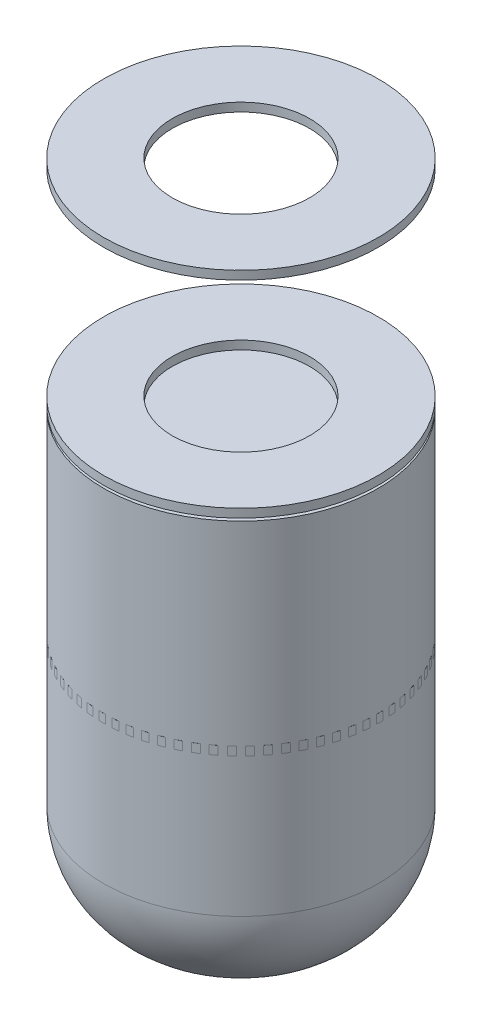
from build123d import *

# Parameters (mm, degrees)
SKETCH2_R           = 50.8
SKETCH2_R_2         = 25.4
BOSS_EXTRUDE1_DEPTH = 1.5875
SKETCH3_R           = 50.8
SKETCH3_R_2         = 25.4
BOSS_EXTRUDE2_DEPTH = 1.5875
SKETCH4_R           = 50.8
SKETCH4_R_2         = 25.4
BOSS_EXTRUDE3_DEPTH = 1.5875


with BuildPart() as part:
    # Sketch1 → Revolve2 (revolve)
    with BuildSketch(Plane.XY):
        with BuildLine():
            Line((-50.8, 0), (0, 0))
            Line((0, 0), (0, -164.719))
            Line((0, -164.719), (-12.7, -164.719))
            ThreePointArc((-12.7, -164.719), (-39.640768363, -153.559768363), (-50.8, -126.619))
            Line((-50.8, -126.619), (-50.8, -115.627099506))
            Line((-50.8, -115.627099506), (-50.8, 0))
        make_face()
    revolve(axis=Axis((0, 164.719, 0), (0, -1, 0)))


with BuildPart() as body_2:
    # Sketch2 → Boss-Extrude1 (new, symmetric)
    with BuildSketch(Plane(origin=(0, 2.54, 0), x_dir=(1, 0, 0), z_dir=(0, 1, 0))):
        with Locations(Location((0, 0, 0), (0, 0, 270))):
            Circle(SKETCH2_R)
        with Locations(Location((0, 0, 0), (0, 0, 270))):
            Circle(SKETCH2_R_2, mode=Mode.SUBTRACT)
    extrude(amount=BOSS_EXTRUDE1_DEPTH, both=True)


with BuildPart() as body_3:
    # Sketch3 → Boss-Extrude2 (new, symmetric)
    with BuildSketch(Plane(origin=(0, 78.74, 0), x_dir=(1, 0, 0), z_dir=(0, 1, 0))):
        with Locations(Location((0, 0, 0), (0, 0, 270))):
            Circle(SKETCH3_R)
        with Locations(Location((0, 0, 0), (0, 0, 270))):
            Circle(SKETCH3_R_2, mode=Mode.SUBTRACT)
    extrude(amount=BOSS_EXTRUDE2_DEPTH, both=True)


with BuildPart() as body_4:
    # Sketch4 → Boss-Extrude3 (new, symmetric)
    with BuildSketch(Plane(origin=(0, -73.66, 0), x_dir=(1, 0, 0), z_dir=(0, 1, 0))):
        with Locations(Location((0, 0, 0), (0, 0, 270))):
            Circle(SKETCH4_R)
        with Locations(Location((0, 0, 0), (0, 0, 270))):
            Circle(SKETCH4_R_2, mode=Mode.SUBTRACT)
    extrude(amount=BOSS_EXTRUDE3_DEPTH, both=True)


solid = Compound([part.part, body_2.part, body_3.part, body_4.part])
